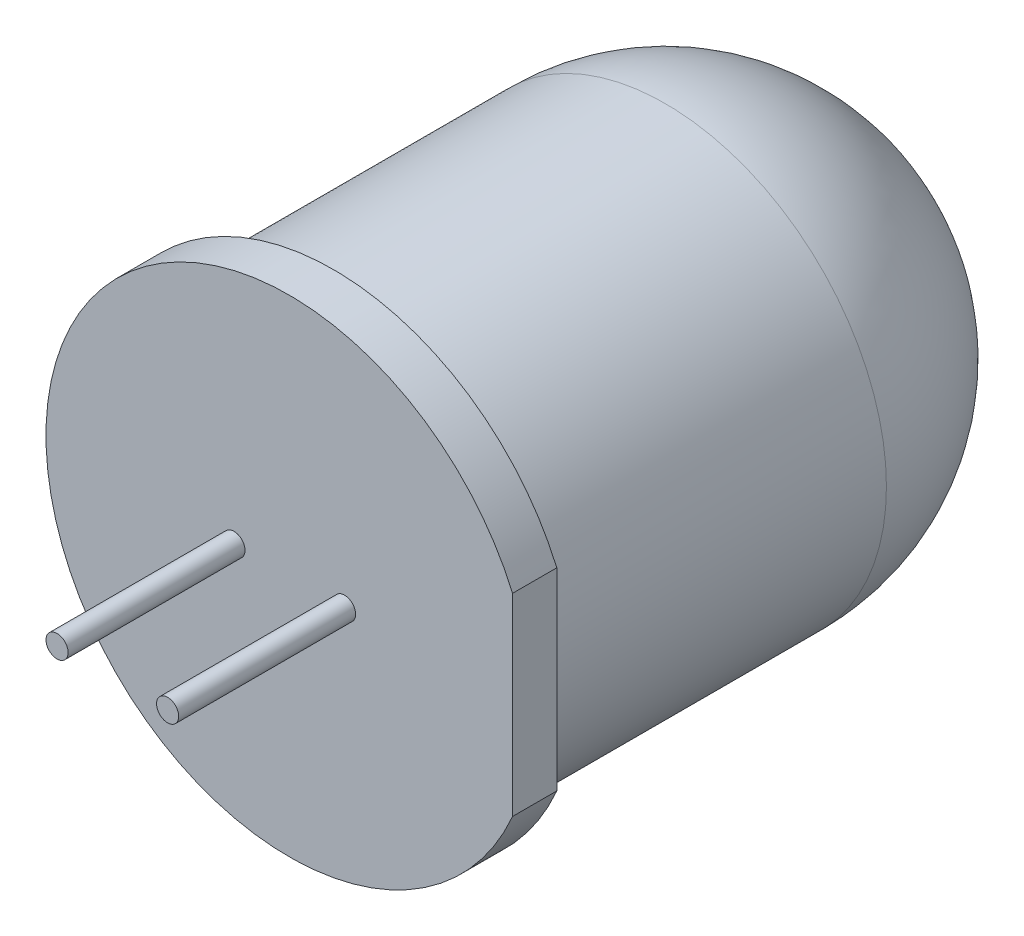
ISO-10303-21;
HEADER;
FILE_DESCRIPTION(('STEP AP214'),'2;1');
FILE_NAME('part.step','',(''),(''),'','','');
FILE_SCHEMA(('AUTOMOTIVE_DESIGN { 1 0 10303 214 1 1 1 1 }'));
ENDSEC;
DATA;
#1=APPLICATION_CONTEXT('core data for automotive mechanical design processes');
#2=APPLICATION_PROTOCOL_DEFINITION('international standard','automotive_design',2000,#1);
#3=PRODUCT_CONTEXT('',#1,'mechanical');
#4=PRODUCT('Part','Part','',(#3));
#5=PRODUCT_RELATED_PRODUCT_CATEGORY('part','',(#4));
#6=PRODUCT_DEFINITION_FORMATION('','',#4);
#7=PRODUCT_DEFINITION_CONTEXT('part definition',#1,'design');
#8=PRODUCT_DEFINITION('design','',#6,#7);
#9=PRODUCT_DEFINITION_SHAPE('','',#8);
#10=(LENGTH_UNIT() NAMED_UNIT(*) SI_UNIT(.MILLI.,.METRE.));
#11=(NAMED_UNIT(*) PLANE_ANGLE_UNIT() SI_UNIT($,.RADIAN.));
#12=(NAMED_UNIT(*) SI_UNIT($,.STERADIAN.) SOLID_ANGLE_UNIT());
#13=UNCERTAINTY_MEASURE_WITH_UNIT(LENGTH_MEASURE(1.E-05),#10,'distance_accuracy_value','');
#14=(GEOMETRIC_REPRESENTATION_CONTEXT(3) GLOBAL_UNCERTAINTY_ASSIGNED_CONTEXT((#13)) GLOBAL_UNIT_ASSIGNED_CONTEXT((#10,
#11,#12)) REPRESENTATION_CONTEXT('',''));
#15=CARTESIAN_POINT('',(0.,0.,0.));
#16=DIRECTION('',(0.,0.,1.));
#17=DIRECTION('',(1.,0.,0.));
#18=AXIS2_PLACEMENT_3D('',#15,#16,#17);
#19=CARTESIAN_POINT('',(0.,0.,13.5));
#20=DIRECTION('',(0.,0.,1.));
#21=DIRECTION('',(1.,0.,0.));
#22=AXIS2_PLACEMENT_3D('',#19,#20,#21);
#23=PLANE('',#22);
#24=CARTESIAN_POINT('',(1.25,0.,13.5));
#25=DIRECTION('',(0.,0.,1.));
#26=DIRECTION('',(1.,0.,0.));
#27=AXIS2_PLACEMENT_3D('',#24,#25,#26);
#28=CIRCLE('',#27,0.25);
#29=CARTESIAN_POINT('',(1.5,0.,13.5));
#30=VERTEX_POINT('',#29);
#31=EDGE_CURVE('E11',#30,#30,#28,.T.);
#32=ORIENTED_EDGE('',*,*,#31,.F.);
#33=EDGE_LOOP('',(#32));
#34=FACE_BOUND('',#33,.T.);
#35=CARTESIAN_POINT('',(0.,0.,13.5));
#36=DIRECTION('',(0.,0.,1.));
#37=DIRECTION('',(1.,0.,0.));
#38=AXIS2_PLACEMENT_3D('',#35,#36,#37);
#39=CIRCLE('',#38,5.5);
#40=CARTESIAN_POINT('',(5.04764087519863,2.1843355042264,13.5));
#41=VERTEX_POINT('',#40);
#42=CARTESIAN_POINT('',(5.04764087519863,-2.1843355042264,13.5));
#43=VERTEX_POINT('',#42);
#44=EDGE_CURVE('E55',#41,#43,#39,.T.);
#45=ORIENTED_EDGE('',*,*,#44,.T.);
#46=DIRECTION('',(0.,1.,0.));
#47=VECTOR('',#46,1.);
#48=CARTESIAN_POINT('',(5.04764087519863,2.1843355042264,13.5));
#49=LINE('',#48,#47);
#50=EDGE_CURVE('E63',#43,#41,#49,.T.);
#51=ORIENTED_EDGE('',*,*,#50,.T.);
#52=EDGE_LOOP('',(#45,#51));
#53=FACE_BOUND('',#52,.T.);
#54=CARTESIAN_POINT('',(-1.25,0.,13.5));
#55=DIRECTION('',(0.,0.,1.));
#56=DIRECTION('',(1.,0.,0.));
#57=AXIS2_PLACEMENT_3D('',#54,#55,#56);
#58=CIRCLE('',#57,0.25);
#59=CARTESIAN_POINT('',(-1.,0.,13.5));
#60=VERTEX_POINT('',#59);
#61=EDGE_CURVE('E159',#60,#60,#58,.T.);
#62=ORIENTED_EDGE('',*,*,#61,.F.);
#63=EDGE_LOOP('',(#62));
#64=FACE_BOUND('',#63,.T.);
#65=ADVANCED_FACE('F26',(#34,#53,#64),#23,.T.);
#66=CARTESIAN_POINT('',(0.,0.,13.5));
#67=DIRECTION('',(0.,0.,-1.));
#68=DIRECTION('',(-1.,0.,0.));
#69=AXIS2_PLACEMENT_3D('',#66,#67,#68);
#70=CYLINDRICAL_SURFACE('',#69,5.);
#71=CARTESIAN_POINT('',(0.,0.,5.));
#72=DIRECTION('',(0.,0.,-1.));
#73=DIRECTION('',(-1.,0.,0.));
#74=AXIS2_PLACEMENT_3D('',#71,#72,#73);
#75=CIRCLE('',#74,5.);
#76=CARTESIAN_POINT('',(-5.,0.,5.));
#77=VERTEX_POINT('',#76);
#78=EDGE_CURVE('E34',#77,#77,#75,.F.);
#79=ORIENTED_EDGE('',*,*,#78,.T.);
#80=EDGE_LOOP('',(#79));
#81=FACE_BOUND('',#80,.T.);
#82=CARTESIAN_POINT('',(0.,0.,12.5));
#83=DIRECTION('',(0.,0.,1.));
#84=DIRECTION('',(1.,0.,0.));
#85=AXIS2_PLACEMENT_3D('',#82,#83,#84);
#86=CIRCLE('',#85,5.);
#87=CARTESIAN_POINT('',(5.,0.,12.5));
#88=VERTEX_POINT('',#87);
#89=EDGE_CURVE('E72',#88,#88,#86,.T.);
#90=ORIENTED_EDGE('',*,*,#89,.F.);
#91=EDGE_LOOP('',(#90));
#92=FACE_BOUND('',#91,.T.);
#93=ADVANCED_FACE('F28',(#81,#92),#70,.T.);
#94=CARTESIAN_POINT('',(0.,0.,12.5));
#95=DIRECTION('',(0.,0.,1.));
#96=DIRECTION('',(1.,0.,0.));
#97=AXIS2_PLACEMENT_3D('',#94,#95,#96);
#98=PLANE('',#97);
#99=CARTESIAN_POINT('',(0.,0.,12.5));
#100=DIRECTION('',(0.,0.,1.));
#101=DIRECTION('',(1.,0.,0.));
#102=AXIS2_PLACEMENT_3D('',#99,#100,#101);
#103=CIRCLE('',#102,5.5);
#104=CARTESIAN_POINT('',(5.04764087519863,2.1843355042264,12.5));
#105=VERTEX_POINT('',#104);
#106=CARTESIAN_POINT('',(5.04764087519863,-2.1843355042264,12.5));
#107=VERTEX_POINT('',#106);
#108=EDGE_CURVE('E57',#105,#107,#103,.T.);
#109=ORIENTED_EDGE('',*,*,#108,.F.);
#110=DIRECTION('',(0.,1.,0.));
#111=VECTOR('',#110,1.);
#112=CARTESIAN_POINT('',(5.04764087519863,2.1843355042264,12.5));
#113=LINE('',#112,#111);
#114=EDGE_CURVE('E59',#107,#105,#113,.T.);
#115=ORIENTED_EDGE('',*,*,#114,.F.);
#116=EDGE_LOOP('',(#109,#115));
#117=FACE_BOUND('',#116,.T.);
#118=ORIENTED_EDGE('',*,*,#89,.T.);
#119=EDGE_LOOP('',(#118));
#120=FACE_BOUND('',#119,.T.);
#121=ADVANCED_FACE('F100',(#117,#120),#98,.F.);
#122=CARTESIAN_POINT('',(0.,0.,12.5));
#123=DIRECTION('',(0.,0.,1.));
#124=DIRECTION('',(1.,0.,0.));
#125=AXIS2_PLACEMENT_3D('',#122,#123,#124);
#126=CYLINDRICAL_SURFACE('',#125,5.5);
#127=ORIENTED_EDGE('',*,*,#44,.F.);
#128=DIRECTION('',(0.,0.,1.));
#129=VECTOR('',#128,1.);
#130=CARTESIAN_POINT('',(5.04764087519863,2.1843355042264,12.5));
#131=LINE('',#130,#129);
#132=EDGE_CURVE('E41',#105,#41,#131,.T.);
#133=ORIENTED_EDGE('',*,*,#132,.F.);
#134=ORIENTED_EDGE('',*,*,#108,.T.);
#135=DIRECTION('',(0.,0.,1.));
#136=VECTOR('',#135,1.);
#137=CARTESIAN_POINT('',(5.04764087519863,-2.1843355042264,12.5));
#138=LINE('',#137,#136);
#139=EDGE_CURVE('E49',#107,#43,#138,.T.);
#140=ORIENTED_EDGE('',*,*,#139,.T.);
#141=EDGE_LOOP('',(#127,#133,#134,#140));
#142=FACE_BOUND('',#141,.T.);
#143=ADVANCED_FACE('F54',(#142),#126,.T.);
#144=CARTESIAN_POINT('',(5.04764087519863,2.1843355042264,12.5));
#145=DIRECTION('',(1.,0.,0.));
#146=DIRECTION('',(0.,0.,-1.));
#147=AXIS2_PLACEMENT_3D('',#144,#145,#146);
#148=PLANE('',#147);
#149=ORIENTED_EDGE('',*,*,#50,.F.);
#150=ORIENTED_EDGE('',*,*,#139,.F.);
#151=ORIENTED_EDGE('',*,*,#114,.T.);
#152=ORIENTED_EDGE('',*,*,#132,.T.);
#153=EDGE_LOOP('',(#149,#150,#151,#152));
#154=FACE_BOUND('',#153,.T.);
#155=ADVANCED_FACE('F66',(#154),#148,.T.);
#156=CARTESIAN_POINT('',(0.,0.,5.));
#157=DIRECTION('',(0.,0.,1.));
#158=DIRECTION('',(1.,0.,0.));
#159=AXIS2_PLACEMENT_3D('',#156,#157,#158);
#160=SPHERICAL_SURFACE('',#159,5.);
#161=ORIENTED_EDGE('',*,*,#78,.F.);
#162=EDGE_LOOP('',(#161));
#163=FACE_BOUND('',#162,.T.);
#164=ADVANCED_FACE('F80',(#163),#160,.T.);
#165=CARTESIAN_POINT('',(-1.25,0.,17.5));
#166=DIRECTION('',(0.,0.,-1.));
#167=DIRECTION('',(-1.,0.,0.));
#168=AXIS2_PLACEMENT_3D('',#165,#166,#167);
#169=CYLINDRICAL_SURFACE('',#168,0.25);
#170=CARTESIAN_POINT('',(-1.25,0.,17.5));
#171=DIRECTION('',(0.,0.,1.));
#172=DIRECTION('',(1.,0.,0.));
#173=AXIS2_PLACEMENT_3D('',#170,#171,#172);
#174=CIRCLE('',#173,0.25);
#175=CARTESIAN_POINT('',(-1.,0.,17.5));
#176=VERTEX_POINT('',#175);
#177=EDGE_CURVE('E64',#176,#176,#174,.T.);
#178=ORIENTED_EDGE('',*,*,#177,.F.);
#179=EDGE_LOOP('',(#178));
#180=FACE_BOUND('',#179,.T.);
#181=ORIENTED_EDGE('',*,*,#61,.T.);
#182=EDGE_LOOP('',(#181));
#183=FACE_BOUND('',#182,.T.);
#184=ADVANCED_FACE('F82',(#180,#183),#169,.T.);
#185=CARTESIAN_POINT('',(-1.25,0.,17.5));
#186=DIRECTION('',(0.,0.,1.));
#187=DIRECTION('',(1.,0.,0.));
#188=AXIS2_PLACEMENT_3D('',#185,#186,#187);
#189=PLANE('',#188);
#190=ORIENTED_EDGE('',*,*,#177,.T.);
#191=EDGE_LOOP('',(#190));
#192=FACE_BOUND('',#191,.T.);
#193=ADVANCED_FACE('F88',(#192),#189,.T.);
#194=CARTESIAN_POINT('',(1.25,0.,17.5));
#195=DIRECTION('',(0.,0.,-1.));
#196=DIRECTION('',(-1.,0.,0.));
#197=AXIS2_PLACEMENT_3D('',#194,#195,#196);
#198=CYLINDRICAL_SURFACE('',#197,0.25);
#199=CARTESIAN_POINT('',(1.25,0.,17.5));
#200=DIRECTION('',(0.,0.,-1.));
#201=DIRECTION('',(-1.,0.,0.));
#202=AXIS2_PLACEMENT_3D('',#199,#200,#201);
#203=CIRCLE('',#202,0.25);
#204=CARTESIAN_POINT('',(1.,0.,17.5));
#205=VERTEX_POINT('',#204);
#206=EDGE_CURVE('E158',#205,#205,#203,.T.);
#207=ORIENTED_EDGE('',*,*,#206,.T.);
#208=EDGE_LOOP('',(#207));
#209=FACE_BOUND('',#208,.T.);
#210=ORIENTED_EDGE('',*,*,#31,.T.);
#211=EDGE_LOOP('',(#210));
#212=FACE_BOUND('',#211,.T.);
#213=ADVANCED_FACE('F139',(#209,#212),#198,.T.);
#214=CARTESIAN_POINT('',(1.25,0.,17.5));
#215=DIRECTION('',(0.,0.,1.));
#216=DIRECTION('',(-1.,0.,0.));
#217=AXIS2_PLACEMENT_3D('',#214,#215,#216);
#218=PLANE('',#217);
#219=ORIENTED_EDGE('',*,*,#206,.F.);
#220=EDGE_LOOP('',(#219));
#221=FACE_BOUND('',#220,.T.);
#222=ADVANCED_FACE('F146',(#221),#218,.T.);
#223=CLOSED_SHELL('',(#65,#93,#121,#143,#155,#164,#184,#193,#213,#222));
#224=MANIFOLD_SOLID_BREP('B2',#223);
#225=ADVANCED_BREP_SHAPE_REPRESENTATION('',(#18,#224),#14);
#226=SHAPE_DEFINITION_REPRESENTATION(#9,#225);
ENDSEC;
END-ISO-10303-21;
